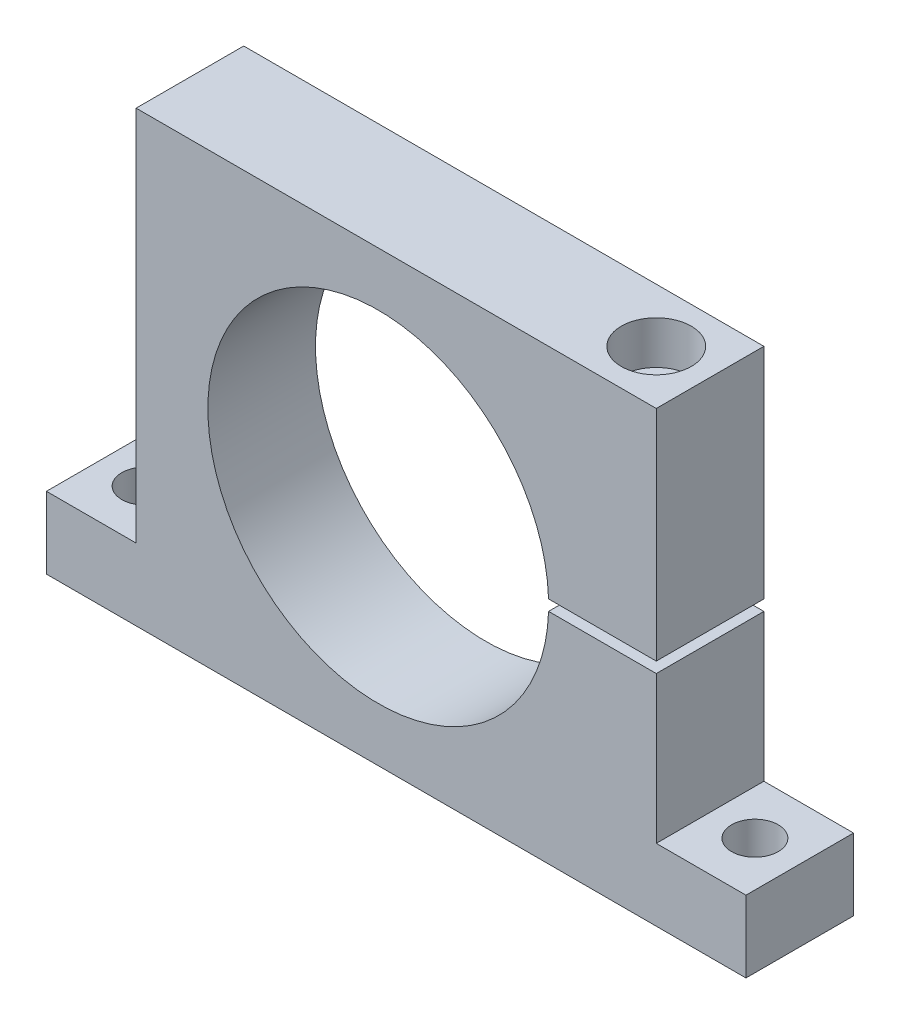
ISO-10303-21;
HEADER;
FILE_DESCRIPTION(('STEP AP214'),'2;1');
FILE_NAME('part.step','',(''),(''),'','','');
FILE_SCHEMA(('AUTOMOTIVE_DESIGN { 1 0 10303 214 1 1 1 1 }'));
ENDSEC;
DATA;
#1=APPLICATION_CONTEXT('core data for automotive mechanical design processes');
#2=APPLICATION_PROTOCOL_DEFINITION('international standard','automotive_design',2000,#1);
#3=PRODUCT_CONTEXT('',#1,'mechanical');
#4=PRODUCT('Part','Part','',(#3));
#5=PRODUCT_RELATED_PRODUCT_CATEGORY('part','',(#4));
#6=PRODUCT_DEFINITION_FORMATION('','',#4);
#7=PRODUCT_DEFINITION_CONTEXT('part definition',#1,'design');
#8=PRODUCT_DEFINITION('design','',#6,#7);
#9=PRODUCT_DEFINITION_SHAPE('','',#8);
#10=(LENGTH_UNIT() NAMED_UNIT(*) SI_UNIT(.MILLI.,.METRE.));
#11=(NAMED_UNIT(*) PLANE_ANGLE_UNIT() SI_UNIT($,.RADIAN.));
#12=(NAMED_UNIT(*) SI_UNIT($,.STERADIAN.) SOLID_ANGLE_UNIT());
#13=UNCERTAINTY_MEASURE_WITH_UNIT(LENGTH_MEASURE(1.E-05),#10,'distance_accuracy_value','');
#14=(GEOMETRIC_REPRESENTATION_CONTEXT(3) GLOBAL_UNCERTAINTY_ASSIGNED_CONTEXT((#13)) GLOBAL_UNIT_ASSIGNED_CONTEXT((#10,
#11,#12)) REPRESENTATION_CONTEXT('',''));
#15=CARTESIAN_POINT('',(0.,0.,0.));
#16=DIRECTION('',(0.,0.,1.));
#17=DIRECTION('',(1.,0.,0.));
#18=AXIS2_PLACEMENT_3D('',#15,#16,#17);
#19=CARTESIAN_POINT('',(77.5,1.49999999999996,15.));
#20=DIRECTION('',(0.,1.,0.));
#21=DIRECTION('',(0.,0.,1.));
#22=AXIS2_PLACEMENT_3D('',#19,#20,#21);
#23=PLANE('',#22);
#24=DIRECTION('',(1.,0.,0.));
#25=VECTOR('',#24,1.);
#26=CARTESIAN_POINT('',(77.5,1.49999999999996,-15.));
#27=LINE('',#26,#25);
#28=CARTESIAN_POINT('',(47.4763098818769,1.49999999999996,-15.));
#29=VERTEX_POINT('',#28);
#30=CARTESIAN_POINT('',(77.5,1.49999999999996,-15.));
#31=VERTEX_POINT('',#30);
#32=EDGE_CURVE('E163',#29,#31,#27,.T.);
#33=ORIENTED_EDGE('',*,*,#32,.T.);
#34=DIRECTION('',(0.,0.,-1.));
#35=VECTOR('',#34,1.);
#36=CARTESIAN_POINT('',(77.5,1.49999999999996,15.));
#37=LINE('',#36,#35);
#38=CARTESIAN_POINT('',(77.5,1.49999999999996,15.));
#39=VERTEX_POINT('',#38);
#40=EDGE_CURVE('E46',#39,#31,#37,.T.);
#41=ORIENTED_EDGE('',*,*,#40,.F.);
#42=DIRECTION('',(1.,0.,0.));
#43=VECTOR('',#42,1.);
#44=CARTESIAN_POINT('',(77.5,1.49999999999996,15.));
#45=LINE('',#44,#43);
#46=CARTESIAN_POINT('',(47.4763098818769,1.49999999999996,15.));
#47=VERTEX_POINT('',#46);
#48=EDGE_CURVE('E110',#47,#39,#45,.T.);
#49=ORIENTED_EDGE('',*,*,#48,.F.);
#50=DIRECTION('',(0.,0.,-1.));
#51=VECTOR('',#50,1.);
#52=CARTESIAN_POINT('',(47.4763098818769,1.49999999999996,15.));
#53=LINE('',#52,#51);
#54=EDGE_CURVE('E11',#47,#29,#53,.T.);
#55=ORIENTED_EDGE('',*,*,#54,.T.);
#56=EDGE_LOOP('',(#33,#41,#49,#55));
#57=FACE_BOUND('',#56,.T.);
#58=CARTESIAN_POINT('',(62.5,1.49999999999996,0.));
#59=DIRECTION('',(0.,1.,0.));
#60=DIRECTION('',(0.,0.,1.));
#61=AXIS2_PLACEMENT_3D('',#58,#59,#60);
#62=CIRCLE('',#61,6.);
#63=CARTESIAN_POINT('',(62.5,1.49999999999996,6.));
#64=VERTEX_POINT('',#63);
#65=EDGE_CURVE('E259',#64,#64,#62,.F.);
#66=ORIENTED_EDGE('',*,*,#65,.F.);
#67=EDGE_LOOP('',(#66));
#68=FACE_BOUND('',#67,.T.);
#69=ADVANCED_FACE('F36',(#57,#68),#23,.F.);
#70=CARTESIAN_POINT('',(-67.5,62.5,15.));
#71=DIRECTION('',(0.,-1.,0.));
#72=DIRECTION('',(0.,0.,-1.));
#73=AXIS2_PLACEMENT_3D('',#70,#71,#72);
#74=PLANE('',#73);
#75=DIRECTION('',(-1.,0.,0.));
#76=VECTOR('',#75,1.);
#77=CARTESIAN_POINT('',(-67.5,62.5,-15.));
#78=LINE('',#77,#76);
#79=CARTESIAN_POINT('',(77.5,62.5,-15.));
#80=VERTEX_POINT('',#79);
#81=CARTESIAN_POINT('',(-67.5,62.5,-15.));
#82=VERTEX_POINT('',#81);
#83=EDGE_CURVE('E168',#80,#82,#78,.T.);
#84=ORIENTED_EDGE('',*,*,#83,.T.);
#85=DIRECTION('',(0.,0.,-1.));
#86=VECTOR('',#85,1.);
#87=CARTESIAN_POINT('',(-67.5,62.5,15.));
#88=LINE('',#87,#86);
#89=CARTESIAN_POINT('',(-67.5,62.5,15.));
#90=VERTEX_POINT('',#89);
#91=EDGE_CURVE('E199',#90,#82,#88,.T.);
#92=ORIENTED_EDGE('',*,*,#91,.F.);
#93=DIRECTION('',(-1.,0.,0.));
#94=VECTOR('',#93,1.);
#95=CARTESIAN_POINT('',(-67.5,62.5,15.));
#96=LINE('',#95,#94);
#97=CARTESIAN_POINT('',(77.5,62.5,15.));
#98=VERTEX_POINT('',#97);
#99=EDGE_CURVE('E230',#98,#90,#96,.T.);
#100=ORIENTED_EDGE('',*,*,#99,.F.);
#101=DIRECTION('',(0.,0.,-1.));
#102=VECTOR('',#101,1.);
#103=CARTESIAN_POINT('',(77.5,62.5,15.));
#104=LINE('',#103,#102);
#105=EDGE_CURVE('E202',#98,#80,#104,.T.);
#106=ORIENTED_EDGE('',*,*,#105,.T.);
#107=EDGE_LOOP('',(#84,#92,#100,#106));
#108=FACE_BOUND('',#107,.T.);
#109=CARTESIAN_POINT('',(62.5,62.5,0.));
#110=DIRECTION('',(0.,1.,0.));
#111=DIRECTION('',(-1.,0.,0.));
#112=AXIS2_PLACEMENT_3D('',#109,#110,#111);
#113=CIRCLE('',#112,9.74999999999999);
#114=CARTESIAN_POINT('',(52.75,62.5,0.));
#115=VERTEX_POINT('',#114);
#116=EDGE_CURVE('E260',#115,#115,#113,.T.);
#117=ORIENTED_EDGE('',*,*,#116,.F.);
#118=EDGE_LOOP('',(#117));
#119=FACE_BOUND('',#118,.T.);
#120=ADVANCED_FACE('F220',(#108,#119),#74,.F.);
#121=CARTESIAN_POINT('',(77.5,-1.50000000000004,15.));
#122=DIRECTION('',(0.,-1.,0.));
#123=DIRECTION('',(0.,0.,-1.));
#124=AXIS2_PLACEMENT_3D('',#121,#122,#123);
#125=PLANE('',#124);
#126=DIRECTION('',(-1.,0.,0.));
#127=VECTOR('',#126,1.);
#128=CARTESIAN_POINT('',(77.5,-1.50000000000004,-15.));
#129=LINE('',#128,#127);
#130=CARTESIAN_POINT('',(77.5,-1.50000000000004,-15.));
#131=VERTEX_POINT('',#130);
#132=CARTESIAN_POINT('',(47.4763098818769,-1.50000000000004,-15.));
#133=VERTEX_POINT('',#132);
#134=EDGE_CURVE('E102',#131,#133,#129,.T.);
#135=ORIENTED_EDGE('',*,*,#134,.T.);
#136=DIRECTION('',(0.,0.,-1.));
#137=VECTOR('',#136,1.);
#138=CARTESIAN_POINT('',(47.4763098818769,-1.50000000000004,15.));
#139=LINE('',#138,#137);
#140=CARTESIAN_POINT('',(47.4763098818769,-1.50000000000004,15.));
#141=VERTEX_POINT('',#140);
#142=EDGE_CURVE('E156',#141,#133,#139,.T.);
#143=ORIENTED_EDGE('',*,*,#142,.F.);
#144=DIRECTION('',(-1.,0.,0.));
#145=VECTOR('',#144,1.);
#146=CARTESIAN_POINT('',(77.5,-1.50000000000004,15.));
#147=LINE('',#146,#145);
#148=CARTESIAN_POINT('',(77.5,-1.50000000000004,15.));
#149=VERTEX_POINT('',#148);
#150=EDGE_CURVE('E54',#149,#141,#147,.T.);
#151=ORIENTED_EDGE('',*,*,#150,.F.);
#152=DIRECTION('',(0.,0.,-1.));
#153=VECTOR('',#152,1.);
#154=CARTESIAN_POINT('',(77.5,-1.50000000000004,15.));
#155=LINE('',#154,#153);
#156=EDGE_CURVE('E152',#149,#131,#155,.T.);
#157=ORIENTED_EDGE('',*,*,#156,.T.);
#158=EDGE_LOOP('',(#135,#143,#151,#157));
#159=FACE_BOUND('',#158,.T.);
#160=CARTESIAN_POINT('',(62.5,-1.50000000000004,0.));
#161=DIRECTION('',(0.,-1.,0.));
#162=DIRECTION('',(0.,0.,-1.));
#163=AXIS2_PLACEMENT_3D('',#160,#161,#162);
#164=CIRCLE('',#163,6.);
#165=CARTESIAN_POINT('',(62.5,-1.50000000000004,-6.));
#166=VERTEX_POINT('',#165);
#167=EDGE_CURVE('E40',#166,#166,#164,.F.);
#168=ORIENTED_EDGE('',*,*,#167,.F.);
#169=EDGE_LOOP('',(#168));
#170=FACE_BOUND('',#169,.T.);
#171=ADVANCED_FACE('F252',(#159,#170),#125,.F.);
#172=CARTESIAN_POINT('',(0.,0.,15.));
#173=DIRECTION('',(0.,0.,-1.));
#174=DIRECTION('',(-1.,0.,0.));
#175=AXIS2_PLACEMENT_3D('',#172,#173,#174);
#176=CYLINDRICAL_SURFACE('',#175,47.5);
#177=CARTESIAN_POINT('',(0.,0.,-15.));
#178=DIRECTION('',(0.,0.,-1.));
#179=DIRECTION('',(1.,0.,0.));
#180=AXIS2_PLACEMENT_3D('',#177,#178,#179);
#181=CIRCLE('',#180,47.5);
#182=EDGE_CURVE('E160',#133,#29,#181,.T.);
#183=ORIENTED_EDGE('',*,*,#182,.T.);
#184=ORIENTED_EDGE('',*,*,#54,.F.);
#185=CARTESIAN_POINT('',(0.,0.,15.));
#186=DIRECTION('',(0.,0.,-1.));
#187=DIRECTION('',(1.,0.,0.));
#188=AXIS2_PLACEMENT_3D('',#185,#186,#187);
#189=CIRCLE('',#188,47.5);
#190=EDGE_CURVE('E183',#141,#47,#189,.T.);
#191=ORIENTED_EDGE('',*,*,#190,.F.);
#192=ORIENTED_EDGE('',*,*,#142,.T.);
#193=EDGE_LOOP('',(#183,#184,#191,#192));
#194=FACE_BOUND('',#193,.T.);
#195=ADVANCED_FACE('F38',(#194),#176,.F.);
#196=CARTESIAN_POINT('',(77.5,62.5,15.));
#197=DIRECTION('',(-1.,0.,0.));
#198=DIRECTION('',(0.,-1.,0.));
#199=AXIS2_PLACEMENT_3D('',#196,#197,#198);
#200=PLANE('',#199);
#201=DIRECTION('',(0.,1.,0.));
#202=VECTOR('',#201,1.);
#203=CARTESIAN_POINT('',(77.5,62.5,-15.));
#204=LINE('',#203,#202);
#205=EDGE_CURVE('E166',#31,#80,#204,.T.);
#206=ORIENTED_EDGE('',*,*,#205,.T.);
#207=ORIENTED_EDGE('',*,*,#105,.F.);
#208=DIRECTION('',(0.,1.,0.));
#209=VECTOR('',#208,1.);
#210=CARTESIAN_POINT('',(77.5,62.5,15.));
#211=LINE('',#210,#209);
#212=EDGE_CURVE('E211',#39,#98,#211,.T.);
#213=ORIENTED_EDGE('',*,*,#212,.F.);
#214=ORIENTED_EDGE('',*,*,#40,.T.);
#215=EDGE_LOOP('',(#206,#207,#213,#214));
#216=FACE_BOUND('',#215,.T.);
#217=ADVANCED_FACE('F209',(#216),#200,.F.);
#218=CARTESIAN_POINT('',(-67.5,-42.5,15.));
#219=DIRECTION('',(1.,0.,0.));
#220=DIRECTION('',(0.,0.,-1.));
#221=AXIS2_PLACEMENT_3D('',#218,#219,#220);
#222=PLANE('',#221);
#223=DIRECTION('',(0.,-1.,0.));
#224=VECTOR('',#223,1.);
#225=CARTESIAN_POINT('',(-67.5,-42.5,-15.));
#226=LINE('',#225,#224);
#227=CARTESIAN_POINT('',(-67.5,-42.5,-15.));
#228=VERTEX_POINT('',#227);
#229=EDGE_CURVE('E170',#82,#228,#226,.T.);
#230=ORIENTED_EDGE('',*,*,#229,.T.);
#231=DIRECTION('',(0.,0.,-1.));
#232=VECTOR('',#231,1.);
#233=CARTESIAN_POINT('',(-67.5,-42.5,15.));
#234=LINE('',#233,#232);
#235=CARTESIAN_POINT('',(-67.5,-42.5,15.));
#236=VERTEX_POINT('',#235);
#237=EDGE_CURVE('E196',#236,#228,#234,.T.);
#238=ORIENTED_EDGE('',*,*,#237,.F.);
#239=DIRECTION('',(0.,-1.,0.));
#240=VECTOR('',#239,1.);
#241=CARTESIAN_POINT('',(-67.5,-42.5,15.));
#242=LINE('',#241,#240);
#243=EDGE_CURVE('E227',#90,#236,#242,.T.);
#244=ORIENTED_EDGE('',*,*,#243,.F.);
#245=ORIENTED_EDGE('',*,*,#91,.T.);
#246=EDGE_LOOP('',(#230,#238,#244,#245));
#247=FACE_BOUND('',#246,.T.);
#248=ADVANCED_FACE('F225',(#247),#222,.F.);
#249=CARTESIAN_POINT('',(-92.5,-42.5,15.));
#250=DIRECTION('',(0.,-1.,0.));
#251=DIRECTION('',(0.,0.,-1.));
#252=AXIS2_PLACEMENT_3D('',#249,#250,#251);
#253=PLANE('',#252);
#254=CARTESIAN_POINT('',(-80.,-42.5,0.));
#255=DIRECTION('',(0.,-1.,0.));
#256=DIRECTION('',(1.,0.,0.));
#257=AXIS2_PLACEMENT_3D('',#254,#255,#256);
#258=CIRCLE('',#257,6.5);
#259=CARTESIAN_POINT('',(-73.5,-42.5,0.));
#260=VERTEX_POINT('',#259);
#261=EDGE_CURVE('E164',#260,#260,#258,.T.);
#262=ORIENTED_EDGE('',*,*,#261,.T.);
#263=EDGE_LOOP('',(#262));
#264=FACE_BOUND('',#263,.T.);
#265=DIRECTION('',(-1.,0.,0.));
#266=VECTOR('',#265,1.);
#267=CARTESIAN_POINT('',(-92.5,-42.5,-15.));
#268=LINE('',#267,#266);
#269=CARTESIAN_POINT('',(-92.5,-42.5,-15.));
#270=VERTEX_POINT('',#269);
#271=EDGE_CURVE('E172',#228,#270,#268,.T.);
#272=ORIENTED_EDGE('',*,*,#271,.T.);
#273=DIRECTION('',(0.,0.,-1.));
#274=VECTOR('',#273,1.);
#275=CARTESIAN_POINT('',(-92.5,-42.5,15.));
#276=LINE('',#275,#274);
#277=CARTESIAN_POINT('',(-92.5,-42.5,15.));
#278=VERTEX_POINT('',#277);
#279=EDGE_CURVE('E193',#278,#270,#276,.T.);
#280=ORIENTED_EDGE('',*,*,#279,.F.);
#281=DIRECTION('',(-1.,0.,0.));
#282=VECTOR('',#281,1.);
#283=CARTESIAN_POINT('',(-92.5,-42.5,15.));
#284=LINE('',#283,#282);
#285=EDGE_CURVE('E229',#236,#278,#284,.T.);
#286=ORIENTED_EDGE('',*,*,#285,.F.);
#287=ORIENTED_EDGE('',*,*,#237,.T.);
#288=EDGE_LOOP('',(#272,#280,#286,#287));
#289=FACE_BOUND('',#288,.T.);
#290=ADVANCED_FACE('F298',(#264,#289),#253,.F.);
#291=CARTESIAN_POINT('',(-92.5,-62.5,15.));
#292=DIRECTION('',(1.,0.,0.));
#293=DIRECTION('',(0.,0.,-1.));
#294=AXIS2_PLACEMENT_3D('',#291,#292,#293);
#295=PLANE('',#294);
#296=DIRECTION('',(0.,-1.,0.));
#297=VECTOR('',#296,1.);
#298=CARTESIAN_POINT('',(-92.5,-62.5,-15.));
#299=LINE('',#298,#297);
#300=CARTESIAN_POINT('',(-92.5,-62.5,-15.));
#301=VERTEX_POINT('',#300);
#302=EDGE_CURVE('E174',#270,#301,#299,.T.);
#303=ORIENTED_EDGE('',*,*,#302,.T.);
#304=DIRECTION('',(0.,0.,-1.));
#305=VECTOR('',#304,1.);
#306=CARTESIAN_POINT('',(-92.5,-62.5,15.));
#307=LINE('',#306,#305);
#308=CARTESIAN_POINT('',(-92.5,-62.5,15.));
#309=VERTEX_POINT('',#308);
#310=EDGE_CURVE('E190',#309,#301,#307,.T.);
#311=ORIENTED_EDGE('',*,*,#310,.F.);
#312=DIRECTION('',(0.,-1.,0.));
#313=VECTOR('',#312,1.);
#314=CARTESIAN_POINT('',(-92.5,-62.5,15.));
#315=LINE('',#314,#313);
#316=EDGE_CURVE('E232',#278,#309,#315,.T.);
#317=ORIENTED_EDGE('',*,*,#316,.F.);
#318=ORIENTED_EDGE('',*,*,#279,.T.);
#319=EDGE_LOOP('',(#303,#311,#317,#318));
#320=FACE_BOUND('',#319,.T.);
#321=ADVANCED_FACE('F290',(#320),#295,.F.);
#322=CARTESIAN_POINT('',(102.5,-62.5,15.));
#323=DIRECTION('',(0.,1.,0.));
#324=DIRECTION('',(0.,0.,1.));
#325=AXIS2_PLACEMENT_3D('',#322,#323,#324);
#326=PLANE('',#325);
#327=CARTESIAN_POINT('',(90.,-62.5,0.));
#328=DIRECTION('',(0.,-1.,0.));
#329=DIRECTION('',(1.,0.,0.));
#330=AXIS2_PLACEMENT_3D('',#327,#328,#329);
#331=CIRCLE('',#330,6.5);
#332=CARTESIAN_POINT('',(96.5,-62.5,0.));
#333=VERTEX_POINT('',#332);
#334=EDGE_CURVE('E262',#333,#333,#331,.T.);
#335=ORIENTED_EDGE('',*,*,#334,.F.);
#336=EDGE_LOOP('',(#335));
#337=FACE_BOUND('',#336,.T.);
#338=CARTESIAN_POINT('',(-80.,-62.5,0.));
#339=DIRECTION('',(0.,-1.,0.));
#340=DIRECTION('',(1.,0.,0.));
#341=AXIS2_PLACEMENT_3D('',#338,#339,#340);
#342=CIRCLE('',#341,6.5);
#343=CARTESIAN_POINT('',(-73.5,-62.5,0.));
#344=VERTEX_POINT('',#343);
#345=EDGE_CURVE('E277',#344,#344,#342,.T.);
#346=ORIENTED_EDGE('',*,*,#345,.F.);
#347=EDGE_LOOP('',(#346));
#348=FACE_BOUND('',#347,.T.);
#349=DIRECTION('',(1.,0.,0.));
#350=VECTOR('',#349,1.);
#351=CARTESIAN_POINT('',(102.5,-62.5,-15.));
#352=LINE('',#351,#350);
#353=CARTESIAN_POINT('',(102.5,-62.5,-15.));
#354=VERTEX_POINT('',#353);
#355=EDGE_CURVE('E176',#301,#354,#352,.T.);
#356=ORIENTED_EDGE('',*,*,#355,.T.);
#357=DIRECTION('',(0.,0.,-1.));
#358=VECTOR('',#357,1.);
#359=CARTESIAN_POINT('',(102.5,-62.5,15.));
#360=LINE('',#359,#358);
#361=CARTESIAN_POINT('',(102.5,-62.5,15.));
#362=VERTEX_POINT('',#361);
#363=EDGE_CURVE('E187',#362,#354,#360,.T.);
#364=ORIENTED_EDGE('',*,*,#363,.F.);
#365=DIRECTION('',(1.,0.,0.));
#366=VECTOR('',#365,1.);
#367=CARTESIAN_POINT('',(102.5,-62.5,15.));
#368=LINE('',#367,#366);
#369=EDGE_CURVE('E238',#309,#362,#368,.T.);
#370=ORIENTED_EDGE('',*,*,#369,.F.);
#371=ORIENTED_EDGE('',*,*,#310,.T.);
#372=EDGE_LOOP('',(#356,#364,#370,#371));
#373=FACE_BOUND('',#372,.T.);
#374=ADVANCED_FACE('F244',(#337,#348,#373),#326,.F.);
#375=CARTESIAN_POINT('',(102.5,-42.5,15.));
#376=DIRECTION('',(-1.,0.,0.));
#377=DIRECTION('',(0.,0.,1.));
#378=AXIS2_PLACEMENT_3D('',#375,#376,#377);
#379=PLANE('',#378);
#380=DIRECTION('',(0.,1.,0.));
#381=VECTOR('',#380,1.);
#382=CARTESIAN_POINT('',(102.5,-42.5,-15.));
#383=LINE('',#382,#381);
#384=CARTESIAN_POINT('',(102.5,-42.5,-15.));
#385=VERTEX_POINT('',#384);
#386=EDGE_CURVE('E178',#354,#385,#383,.T.);
#387=ORIENTED_EDGE('',*,*,#386,.T.);
#388=DIRECTION('',(0.,0.,-1.));
#389=VECTOR('',#388,1.);
#390=CARTESIAN_POINT('',(102.5,-42.5,15.));
#391=LINE('',#390,#389);
#392=CARTESIAN_POINT('',(102.5,-42.5,15.));
#393=VERTEX_POINT('',#392);
#394=EDGE_CURVE('E151',#393,#385,#391,.T.);
#395=ORIENTED_EDGE('',*,*,#394,.F.);
#396=DIRECTION('',(0.,1.,0.));
#397=VECTOR('',#396,1.);
#398=CARTESIAN_POINT('',(102.5,-42.5,15.));
#399=LINE('',#398,#397);
#400=EDGE_CURVE('E142',#362,#393,#399,.T.);
#401=ORIENTED_EDGE('',*,*,#400,.F.);
#402=ORIENTED_EDGE('',*,*,#363,.T.);
#403=EDGE_LOOP('',(#387,#395,#401,#402));
#404=FACE_BOUND('',#403,.T.);
#405=ADVANCED_FACE('F248',(#404),#379,.F.);
#406=CARTESIAN_POINT('',(77.5,-42.5,15.));
#407=DIRECTION('',(0.,-1.,0.));
#408=DIRECTION('',(0.,0.,-1.));
#409=AXIS2_PLACEMENT_3D('',#406,#407,#408);
#410=PLANE('',#409);
#411=CARTESIAN_POINT('',(90.,-42.5,0.));
#412=DIRECTION('',(0.,-1.,0.));
#413=DIRECTION('',(1.,0.,0.));
#414=AXIS2_PLACEMENT_3D('',#411,#412,#413);
#415=CIRCLE('',#414,6.5);
#416=CARTESIAN_POINT('',(96.5,-42.5,0.));
#417=VERTEX_POINT('',#416);
#418=EDGE_CURVE('E274',#417,#417,#415,.T.);
#419=ORIENTED_EDGE('',*,*,#418,.T.);
#420=EDGE_LOOP('',(#419));
#421=FACE_BOUND('',#420,.T.);
#422=DIRECTION('',(-1.,0.,0.));
#423=VECTOR('',#422,1.);
#424=CARTESIAN_POINT('',(77.5,-42.5,-15.));
#425=LINE('',#424,#423);
#426=CARTESIAN_POINT('',(77.5,-42.5,-15.));
#427=VERTEX_POINT('',#426);
#428=EDGE_CURVE('E150',#385,#427,#425,.T.);
#429=ORIENTED_EDGE('',*,*,#428,.T.);
#430=DIRECTION('',(0.,0.,-1.));
#431=VECTOR('',#430,1.);
#432=CARTESIAN_POINT('',(77.5,-42.5,15.));
#433=LINE('',#432,#431);
#434=CARTESIAN_POINT('',(77.5,-42.5,15.));
#435=VERTEX_POINT('',#434);
#436=EDGE_CURVE('E147',#435,#427,#433,.T.);
#437=ORIENTED_EDGE('',*,*,#436,.F.);
#438=DIRECTION('',(-1.,0.,0.));
#439=VECTOR('',#438,1.);
#440=CARTESIAN_POINT('',(77.5,-42.5,15.));
#441=LINE('',#440,#439);
#442=EDGE_CURVE('E136',#393,#435,#441,.T.);
#443=ORIENTED_EDGE('',*,*,#442,.F.);
#444=ORIENTED_EDGE('',*,*,#394,.T.);
#445=EDGE_LOOP('',(#429,#437,#443,#444));
#446=FACE_BOUND('',#445,.T.);
#447=ADVANCED_FACE('F148',(#421,#446),#410,.F.);
#448=CARTESIAN_POINT('',(77.5,-1.50000000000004,15.));
#449=DIRECTION('',(-1.,0.,0.));
#450=DIRECTION('',(0.,0.,1.));
#451=AXIS2_PLACEMENT_3D('',#448,#449,#450);
#452=PLANE('',#451);
#453=DIRECTION('',(0.,1.,0.));
#454=VECTOR('',#453,1.);
#455=CARTESIAN_POINT('',(77.5,-1.50000000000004,-15.));
#456=LINE('',#455,#454);
#457=EDGE_CURVE('E96',#427,#131,#456,.T.);
#458=ORIENTED_EDGE('',*,*,#457,.T.);
#459=ORIENTED_EDGE('',*,*,#156,.F.);
#460=DIRECTION('',(0.,1.,0.));
#461=VECTOR('',#460,1.);
#462=CARTESIAN_POINT('',(77.5,-1.50000000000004,15.));
#463=LINE('',#462,#461);
#464=EDGE_CURVE('E140',#435,#149,#463,.T.);
#465=ORIENTED_EDGE('',*,*,#464,.F.);
#466=ORIENTED_EDGE('',*,*,#436,.T.);
#467=EDGE_LOOP('',(#458,#459,#465,#466));
#468=FACE_BOUND('',#467,.T.);
#469=ADVANCED_FACE('F154',(#468),#452,.F.);
#470=CARTESIAN_POINT('',(0.,0.,15.));
#471=DIRECTION('',(0.,0.,1.));
#472=DIRECTION('',(1.,0.,0.));
#473=AXIS2_PLACEMENT_3D('',#470,#471,#472);
#474=PLANE('',#473);
#475=ORIENTED_EDGE('',*,*,#190,.T.);
#476=ORIENTED_EDGE('',*,*,#48,.T.);
#477=ORIENTED_EDGE('',*,*,#212,.T.);
#478=ORIENTED_EDGE('',*,*,#99,.T.);
#479=ORIENTED_EDGE('',*,*,#243,.T.);
#480=ORIENTED_EDGE('',*,*,#285,.T.);
#481=ORIENTED_EDGE('',*,*,#316,.T.);
#482=ORIENTED_EDGE('',*,*,#369,.T.);
#483=ORIENTED_EDGE('',*,*,#400,.T.);
#484=ORIENTED_EDGE('',*,*,#442,.T.);
#485=ORIENTED_EDGE('',*,*,#464,.T.);
#486=ORIENTED_EDGE('',*,*,#150,.T.);
#487=EDGE_LOOP('',(#475,#476,#477,#478,#479,#480,#481,#482,#483,#484,#485,#486));
#488=FACE_BOUND('',#487,.T.);
#489=ADVANCED_FACE('F138',(#488),#474,.T.);
#490=CARTESIAN_POINT('',(0.,0.,-15.));
#491=DIRECTION('',(0.,0.,1.));
#492=DIRECTION('',(1.,0.,0.));
#493=AXIS2_PLACEMENT_3D('',#490,#491,#492);
#494=PLANE('',#493);
#495=ORIENTED_EDGE('',*,*,#182,.F.);
#496=ORIENTED_EDGE('',*,*,#134,.F.);
#497=ORIENTED_EDGE('',*,*,#457,.F.);
#498=ORIENTED_EDGE('',*,*,#428,.F.);
#499=ORIENTED_EDGE('',*,*,#386,.F.);
#500=ORIENTED_EDGE('',*,*,#355,.F.);
#501=ORIENTED_EDGE('',*,*,#302,.F.);
#502=ORIENTED_EDGE('',*,*,#271,.F.);
#503=ORIENTED_EDGE('',*,*,#229,.F.);
#504=ORIENTED_EDGE('',*,*,#83,.F.);
#505=ORIENTED_EDGE('',*,*,#205,.F.);
#506=ORIENTED_EDGE('',*,*,#32,.F.);
#507=EDGE_LOOP('',(#495,#496,#497,#498,#499,#500,#501,#502,#503,#504,#505,#506));
#508=FACE_BOUND('',#507,.T.);
#509=ADVANCED_FACE('F215',(#508),#494,.F.);
#510=CARTESIAN_POINT('',(-80.,-42.5,0.));
#511=DIRECTION('',(0.,-1.,0.));
#512=DIRECTION('',(1.,0.,0.));
#513=AXIS2_PLACEMENT_3D('',#510,#511,#512);
#514=CYLINDRICAL_SURFACE('',#513,6.5);
#515=ORIENTED_EDGE('',*,*,#261,.F.);
#516=EDGE_LOOP('',(#515));
#517=FACE_BOUND('',#516,.T.);
#518=ORIENTED_EDGE('',*,*,#345,.T.);
#519=EDGE_LOOP('',(#518));
#520=FACE_BOUND('',#519,.T.);
#521=ADVANCED_FACE('F287',(#517,#520),#514,.F.);
#522=CARTESIAN_POINT('',(90.,-42.5,0.));
#523=DIRECTION('',(0.,-1.,0.));
#524=DIRECTION('',(1.,0.,0.));
#525=AXIS2_PLACEMENT_3D('',#522,#523,#524);
#526=CYLINDRICAL_SURFACE('',#525,6.5);
#527=ORIENTED_EDGE('',*,*,#418,.F.);
#528=EDGE_LOOP('',(#527));
#529=FACE_BOUND('',#528,.T.);
#530=ORIENTED_EDGE('',*,*,#334,.T.);
#531=EDGE_LOOP('',(#530));
#532=FACE_BOUND('',#531,.T.);
#533=ADVANCED_FACE('F323',(#529,#532),#526,.F.);
#534=CARTESIAN_POINT('',(62.5,-51.1051637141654,0.));
#535=DIRECTION('',(0.,1.,0.));
#536=DIRECTION('',(-1.,0.,0.));
#537=AXIS2_PLACEMENT_3D('',#534,#535,#536);
#538=CONICAL_SURFACE('',#537,0.,1.02974425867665);
#539=CARTESIAN_POINT('',(62.5,-47.5,0.));
#540=DIRECTION('',(0.,1.,0.));
#541=DIRECTION('',(-1.,0.,0.));
#542=AXIS2_PLACEMENT_3D('',#539,#540,#541);
#543=CIRCLE('',#542,5.99999999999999);
#544=CARTESIAN_POINT('',(56.5,-47.5,0.));
#545=VERTEX_POINT('',#544);
#546=EDGE_CURVE('E480',#545,#545,#543,.T.);
#547=ORIENTED_EDGE('',*,*,#546,.T.);
#548=EDGE_LOOP('',(#547));
#549=FACE_BOUND('',#548,.T.);
#550=CARTESIAN_POINT('',(62.5,-51.1051637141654,0.));
#551=VERTEX_POINT('',#550);
#552=VERTEX_LOOP('',#551);
#553=FACE_BOUND('',#552,.T.);
#554=ADVANCED_FACE('F329',(#549,#553),#538,.F.);
#555=CARTESIAN_POINT('',(62.5,62.5,0.));
#556=DIRECTION('',(0.,1.,0.));
#557=DIRECTION('',(-1.,0.,0.));
#558=AXIS2_PLACEMENT_3D('',#555,#556,#557);
#559=CYLINDRICAL_SURFACE('',#558,6.);
#560=ORIENTED_EDGE('',*,*,#546,.F.);
#561=EDGE_LOOP('',(#560));
#562=FACE_BOUND('',#561,.T.);
#563=ORIENTED_EDGE('',*,*,#167,.T.);
#564=EDGE_LOOP('',(#563));
#565=FACE_BOUND('',#564,.T.);
#566=ADVANCED_FACE('F435',(#562,#565),#559,.F.);
#567=CARTESIAN_POINT('',(62.5,50.5,0.));
#568=DIRECTION('',(0.,1.,0.));
#569=DIRECTION('',(-1.,0.,0.));
#570=AXIS2_PLACEMENT_3D('',#567,#568,#569);
#571=CIRCLE('',#570,6.);
#572=CARTESIAN_POINT('',(56.5,50.5,0.));
#573=VERTEX_POINT('',#572);
#574=EDGE_CURVE('E270',#573,#573,#571,.T.);
#575=ORIENTED_EDGE('',*,*,#574,.T.);
#576=EDGE_LOOP('',(#575));
#577=FACE_BOUND('',#576,.T.);
#578=ORIENTED_EDGE('',*,*,#65,.T.);
#579=EDGE_LOOP('',(#578));
#580=FACE_BOUND('',#579,.T.);
#581=ADVANCED_FACE('F442',(#577,#580),#559,.F.);
#582=CARTESIAN_POINT('',(62.5,62.5,0.));
#583=DIRECTION('',(0.,1.,0.));
#584=DIRECTION('',(-1.,0.,0.));
#585=AXIS2_PLACEMENT_3D('',#582,#583,#584);
#586=CYLINDRICAL_SURFACE('',#585,9.74999999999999);
#587=ORIENTED_EDGE('',*,*,#116,.T.);
#588=EDGE_LOOP('',(#587));
#589=FACE_BOUND('',#588,.T.);
#590=CARTESIAN_POINT('',(62.5,50.5,0.));
#591=DIRECTION('',(0.,1.,0.));
#592=DIRECTION('',(-1.,0.,0.));
#593=AXIS2_PLACEMENT_3D('',#590,#591,#592);
#594=CIRCLE('',#593,9.74999999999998);
#595=CARTESIAN_POINT('',(52.75,50.5,0.));
#596=VERTEX_POINT('',#595);
#597=EDGE_CURVE('E265',#596,#596,#594,.T.);
#598=ORIENTED_EDGE('',*,*,#597,.F.);
#599=EDGE_LOOP('',(#598));
#600=FACE_BOUND('',#599,.T.);
#601=ADVANCED_FACE('F450',(#589,#600),#586,.F.);
#602=CARTESIAN_POINT('',(72.25,50.5,0.));
#603=DIRECTION('',(0.,1.,0.));
#604=DIRECTION('',(-1.,0.,0.));
#605=AXIS2_PLACEMENT_3D('',#602,#603,#604);
#606=PLANE('',#605);
#607=ORIENTED_EDGE('',*,*,#597,.T.);
#608=EDGE_LOOP('',(#607));
#609=FACE_BOUND('',#608,.T.);
#610=ORIENTED_EDGE('',*,*,#574,.F.);
#611=EDGE_LOOP('',(#610));
#612=FACE_BOUND('',#611,.T.);
#613=ADVANCED_FACE('F457',(#609,#612),#606,.T.);
#614=CLOSED_SHELL('',(#69,#120,#171,#195,#217,#248,#290,#321,#374,#405,#447,#469,#489,#509,#521,
#533,#554,#566,#581,#601,#613));
#615=MANIFOLD_SOLID_BREP('B2',#614);
#616=ADVANCED_BREP_SHAPE_REPRESENTATION('',(#18,#615),#14);
#617=SHAPE_DEFINITION_REPRESENTATION(#9,#616);
ENDSEC;
END-ISO-10303-21;
